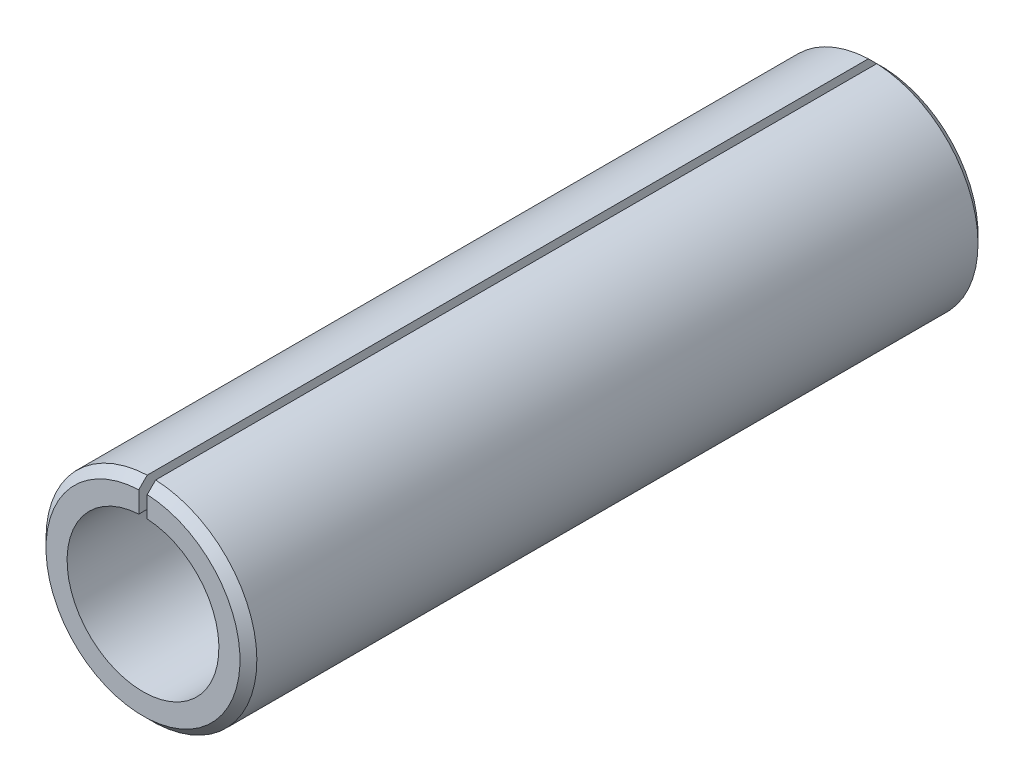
ISO-10303-21;
HEADER;
FILE_DESCRIPTION(('STEP AP214'),'2;1');
FILE_NAME('part.step','',(''),(''),'','','');
FILE_SCHEMA(('AUTOMOTIVE_DESIGN { 1 0 10303 214 1 1 1 1 }'));
ENDSEC;
DATA;
#1=APPLICATION_CONTEXT('core data for automotive mechanical design processes');
#2=APPLICATION_PROTOCOL_DEFINITION('international standard','automotive_design',2000,#1);
#3=PRODUCT_CONTEXT('',#1,'mechanical');
#4=PRODUCT('Part','Part','',(#3));
#5=PRODUCT_RELATED_PRODUCT_CATEGORY('part','',(#4));
#6=PRODUCT_DEFINITION_FORMATION('','',#4);
#7=PRODUCT_DEFINITION_CONTEXT('part definition',#1,'design');
#8=PRODUCT_DEFINITION('design','',#6,#7);
#9=PRODUCT_DEFINITION_SHAPE('','',#8);
#10=(LENGTH_UNIT() NAMED_UNIT(*) SI_UNIT(.MILLI.,.METRE.));
#11=(NAMED_UNIT(*) PLANE_ANGLE_UNIT() SI_UNIT($,.RADIAN.));
#12=(NAMED_UNIT(*) SI_UNIT($,.STERADIAN.) SOLID_ANGLE_UNIT());
#13=UNCERTAINTY_MEASURE_WITH_UNIT(LENGTH_MEASURE(1.E-05),#10,'distance_accuracy_value','');
#14=(GEOMETRIC_REPRESENTATION_CONTEXT(3) GLOBAL_UNCERTAINTY_ASSIGNED_CONTEXT((#13)) GLOBAL_UNIT_ASSIGNED_CONTEXT((#10,
#11,#12)) REPRESENTATION_CONTEXT('',''));
#15=CARTESIAN_POINT('',(0.,0.,0.));
#16=DIRECTION('',(0.,0.,1.));
#17=DIRECTION('',(1.,0.,0.));
#18=AXIS2_PLACEMENT_3D('',#15,#16,#17);
#19=CARTESIAN_POINT('',(0.,0.,5.55625));
#20=DIRECTION('',(0.,0.,-1.));
#21=DIRECTION('',(-1.,0.,0.));
#22=AXIS2_PLACEMENT_3D('',#19,#20,#21);
#23=CYLINDRICAL_SURFACE('',#22,1.143);
#24=CARTESIAN_POINT('',(0.,0.,-5.55625));
#25=DIRECTION('',(0.,0.,-1.));
#26=DIRECTION('',(1.,0.,0.));
#27=AXIS2_PLACEMENT_3D('',#24,#25,#26);
#28=CIRCLE('',#27,1.143);
#29=CARTESIAN_POINT('',(0.0635,1.14123474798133,-5.55625));
#30=VERTEX_POINT('',#29);
#31=CARTESIAN_POINT('',(-0.0635,1.14123474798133,-5.55625));
#32=VERTEX_POINT('',#31);
#33=EDGE_CURVE('E109',#30,#32,#28,.T.);
#34=ORIENTED_EDGE('',*,*,#33,.T.);
#35=DIRECTION('',(0.,0.,-1.));
#36=VECTOR('',#35,1.);
#37=CARTESIAN_POINT('',(-0.0635,1.14123474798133,5.55625));
#38=LINE('',#37,#36);
#39=CARTESIAN_POINT('',(-0.0635,1.14123474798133,5.55625));
#40=VERTEX_POINT('',#39);
#41=EDGE_CURVE('E93',#40,#32,#38,.T.);
#42=ORIENTED_EDGE('',*,*,#41,.F.);
#43=CARTESIAN_POINT('',(0.,0.,5.55625));
#44=DIRECTION('',(0.,0.,-1.));
#45=DIRECTION('',(1.,0.,0.));
#46=AXIS2_PLACEMENT_3D('',#43,#44,#45);
#47=CIRCLE('',#46,1.143);
#48=CARTESIAN_POINT('',(0.0635,1.14123474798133,5.55625));
#49=VERTEX_POINT('',#48);
#50=EDGE_CURVE('E98',#49,#40,#47,.T.);
#51=ORIENTED_EDGE('',*,*,#50,.F.);
#52=DIRECTION('',(0.,0.,-1.));
#53=VECTOR('',#52,1.);
#54=CARTESIAN_POINT('',(0.0635,1.14123474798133,5.55625));
#55=LINE('',#54,#53);
#56=EDGE_CURVE('E225',#49,#30,#55,.T.);
#57=ORIENTED_EDGE('',*,*,#56,.T.);
#58=EDGE_LOOP('',(#34,#42,#51,#57));
#59=FACE_BOUND('',#58,.T.);
#60=ADVANCED_FACE('F35',(#59),#23,.F.);
#61=CARTESIAN_POINT('',(-0.0635,1.14123474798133,5.55625));
#62=DIRECTION('',(-1.,0.,0.));
#63=DIRECTION('',(0.,0.,1.));
#64=AXIS2_PLACEMENT_3D('',#61,#62,#63);
#65=PLANE('',#64);
#66=DIRECTION('',(0.,1.,0.));
#67=VECTOR('',#66,1.);
#68=CARTESIAN_POINT('',(-0.0635,1.14123474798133,-5.55625));
#69=LINE('',#68,#67);
#70=CARTESIAN_POINT('',(-0.0635,1.45911891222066,-5.55625));
#71=VERTEX_POINT('',#70);
#72=EDGE_CURVE('E217',#32,#71,#69,.T.);
#73=ORIENTED_EDGE('',*,*,#72,.T.);
#74=CARTESIAN_POINT('',(-0.0635,1.45911891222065,-5.55625));
#75=CARTESIAN_POINT('',(-0.0635,1.48030477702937,-5.53508410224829));
#76=CARTESIAN_POINT('',(-0.0635,1.50149025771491,-5.51391782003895));
#77=CARTESIAN_POINT('',(-0.0635,1.54386045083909,-5.47158448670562));
#78=CARTESIAN_POINT('',(-0.0635,1.56504516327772,-5.45041743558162));
#79=CARTESIAN_POINT('',(-0.0635,1.58622949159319,-5.42925));
#80=B_SPLINE_CURVE_WITH_KNOTS('',3,(#74,#75,#76,#77,#78,#79),.UNSPECIFIED.,.F.,.F.,(4,2,4),(0.,
0.0898416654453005,0.179683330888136),.UNSPECIFIED.);
#81=CARTESIAN_POINT('',(-0.0634999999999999,1.58622949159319,-5.42925));
#82=VERTEX_POINT('',#81);
#83=EDGE_CURVE('E44',#71,#82,#80,.T.);
#84=ORIENTED_EDGE('',*,*,#83,.T.);
#85=DIRECTION('',(0.,0.,-1.));
#86=VECTOR('',#85,1.);
#87=CARTESIAN_POINT('',(-0.0634999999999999,1.58622949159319,5.55625));
#88=LINE('',#87,#86);
#89=CARTESIAN_POINT('',(-0.0634999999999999,1.58622949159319,5.42925));
#90=VERTEX_POINT('',#89);
#91=EDGE_CURVE('E111',#90,#82,#88,.T.);
#92=ORIENTED_EDGE('',*,*,#91,.F.);
#93=CARTESIAN_POINT('',(-0.0634999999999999,1.58622949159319,5.42925));
#94=CARTESIAN_POINT('',(-0.0635,1.56504516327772,5.45041743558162));
#95=CARTESIAN_POINT('',(-0.0635,1.54386045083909,5.47158448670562));
#96=CARTESIAN_POINT('',(-0.0635,1.50149025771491,5.51391782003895));
#97=CARTESIAN_POINT('',(-0.0635,1.48030477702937,5.53508410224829));
#98=CARTESIAN_POINT('',(-0.0635,1.45911891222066,5.55625));
#99=B_SPLINE_CURVE_WITH_KNOTS('',3,(#93,#94,#95,#96,#97,#98),.UNSPECIFIED.,.F.,.F.,(4,2,4),(0.,
0.0898416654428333,0.179683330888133),.UNSPECIFIED.);
#100=CARTESIAN_POINT('',(-0.0635,1.45911891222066,5.55625));
#101=VERTEX_POINT('',#100);
#102=EDGE_CURVE('E51',#90,#101,#99,.T.);
#103=ORIENTED_EDGE('',*,*,#102,.T.);
#104=DIRECTION('',(0.,1.,0.));
#105=VECTOR('',#104,1.);
#106=CARTESIAN_POINT('',(-0.0635,1.14123474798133,5.55625));
#107=LINE('',#106,#105);
#108=EDGE_CURVE('E89',#40,#101,#107,.T.);
#109=ORIENTED_EDGE('',*,*,#108,.F.);
#110=ORIENTED_EDGE('',*,*,#41,.T.);
#111=EDGE_LOOP('',(#73,#84,#92,#103,#109,#110));
#112=FACE_BOUND('',#111,.T.);
#113=ADVANCED_FACE('F91',(#112),#65,.F.);
#114=CARTESIAN_POINT('',(0.,0.,5.55625));
#115=DIRECTION('',(0.,0.,-1.));
#116=DIRECTION('',(-1.,0.,0.));
#117=AXIS2_PLACEMENT_3D('',#114,#115,#116);
#118=CYLINDRICAL_SURFACE('',#117,1.5875);
#119=ORIENTED_EDGE('',*,*,#91,.T.);
#120=CARTESIAN_POINT('',(0.,0.,-5.42925));
#121=DIRECTION('',(0.,0.,1.));
#122=DIRECTION('',(1.,0.,0.));
#123=AXIS2_PLACEMENT_3D('',#120,#121,#122);
#124=CIRCLE('',#123,1.5875);
#125=CARTESIAN_POINT('',(0.0635,1.58622949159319,-5.42925));
#126=VERTEX_POINT('',#125);
#127=EDGE_CURVE('E113',#82,#126,#124,.T.);
#128=ORIENTED_EDGE('',*,*,#127,.T.);
#129=DIRECTION('',(0.,0.,-1.));
#130=VECTOR('',#129,1.);
#131=CARTESIAN_POINT('',(0.0635,1.58622949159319,5.55625));
#132=LINE('',#131,#130);
#133=CARTESIAN_POINT('',(0.0635,1.58622949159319,5.42925));
#134=VERTEX_POINT('',#133);
#135=EDGE_CURVE('E116',#134,#126,#132,.T.);
#136=ORIENTED_EDGE('',*,*,#135,.F.);
#137=CARTESIAN_POINT('',(0.,0.,5.42925));
#138=DIRECTION('',(0.,0.,1.));
#139=DIRECTION('',(1.,0.,0.));
#140=AXIS2_PLACEMENT_3D('',#137,#138,#139);
#141=CIRCLE('',#140,1.5875);
#142=EDGE_CURVE('E110',#134,#90,#141,.F.);
#143=ORIENTED_EDGE('',*,*,#142,.T.);
#144=EDGE_LOOP('',(#119,#128,#136,#143));
#145=FACE_BOUND('',#144,.T.);
#146=ADVANCED_FACE('F138',(#145),#118,.T.);
#147=CARTESIAN_POINT('',(0.0635,1.14123474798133,5.55625));
#148=DIRECTION('',(1.,0.,0.));
#149=DIRECTION('',(0.,0.,-1.));
#150=AXIS2_PLACEMENT_3D('',#147,#148,#149);
#151=PLANE('',#150);
#152=ORIENTED_EDGE('',*,*,#135,.T.);
#153=CARTESIAN_POINT('',(0.0635,1.58622949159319,-5.42925));
#154=CARTESIAN_POINT('',(0.0635,1.56504516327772,-5.45041743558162));
#155=CARTESIAN_POINT('',(0.0635,1.54386045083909,-5.47158448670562));
#156=CARTESIAN_POINT('',(0.0635,1.50149025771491,-5.51391782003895));
#157=CARTESIAN_POINT('',(0.0635,1.48030477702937,-5.53508410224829));
#158=CARTESIAN_POINT('',(0.0635,1.45911891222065,-5.55625));
#159=B_SPLINE_CURVE_WITH_KNOTS('',3,(#153,#154,#155,#156,#157,#158),.UNSPECIFIED.,.F.,.F.,(4,2,
4),(0.,0.0898416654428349,0.179683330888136),.UNSPECIFIED.);
#160=CARTESIAN_POINT('',(0.0635,1.45911891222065,-5.55625));
#161=VERTEX_POINT('',#160);
#162=EDGE_CURVE('E128',#126,#161,#159,.T.);
#163=ORIENTED_EDGE('',*,*,#162,.T.);
#164=DIRECTION('',(0.,-1.,0.));
#165=VECTOR('',#164,1.);
#166=CARTESIAN_POINT('',(0.0635,1.14123474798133,-5.55625));
#167=LINE('',#166,#165);
#168=EDGE_CURVE('E106',#161,#30,#167,.T.);
#169=ORIENTED_EDGE('',*,*,#168,.T.);
#170=ORIENTED_EDGE('',*,*,#56,.F.);
#171=DIRECTION('',(0.,-1.,0.));
#172=VECTOR('',#171,1.);
#173=CARTESIAN_POINT('',(0.0635,1.14123474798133,5.55625));
#174=LINE('',#173,#172);
#175=CARTESIAN_POINT('',(0.0635,1.45911891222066,5.55625));
#176=VERTEX_POINT('',#175);
#177=EDGE_CURVE('E97',#176,#49,#174,.T.);
#178=ORIENTED_EDGE('',*,*,#177,.F.);
#179=CARTESIAN_POINT('',(0.0635,1.45911891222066,5.55625));
#180=CARTESIAN_POINT('',(0.0635,1.48030477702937,5.53508410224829));
#181=CARTESIAN_POINT('',(0.0635,1.50149025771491,5.51391782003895));
#182=CARTESIAN_POINT('',(0.0635,1.54386045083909,5.47158448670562));
#183=CARTESIAN_POINT('',(0.0635,1.56504516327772,5.45041743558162));
#184=CARTESIAN_POINT('',(0.0635,1.58622949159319,5.42925));
#185=B_SPLINE_CURVE_WITH_KNOTS('',3,(#179,#180,#181,#182,#183,#184),.UNSPECIFIED.,.F.,.F.,(4,2,
4),(0.,0.089841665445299,0.179683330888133),.UNSPECIFIED.);
#186=EDGE_CURVE('E122',#176,#134,#185,.T.);
#187=ORIENTED_EDGE('',*,*,#186,.T.);
#188=EDGE_LOOP('',(#152,#163,#169,#170,#178,#187));
#189=FACE_BOUND('',#188,.T.);
#190=ADVANCED_FACE('F133',(#189),#151,.F.);
#191=CARTESIAN_POINT('',(0.,0.,5.55625));
#192=DIRECTION('',(0.,0.,1.));
#193=DIRECTION('',(1.,0.,0.));
#194=AXIS2_PLACEMENT_3D('',#191,#192,#193);
#195=PLANE('',#194);
#196=ORIENTED_EDGE('',*,*,#108,.T.);
#197=CARTESIAN_POINT('',(0.,0.,5.55625));
#198=DIRECTION('',(0.,0.,1.));
#199=DIRECTION('',(1.,0.,0.));
#200=AXIS2_PLACEMENT_3D('',#197,#198,#199);
#201=CIRCLE('',#200,1.4605);
#202=EDGE_CURVE('E11',#101,#176,#201,.T.);
#203=ORIENTED_EDGE('',*,*,#202,.T.);
#204=ORIENTED_EDGE('',*,*,#177,.T.);
#205=ORIENTED_EDGE('',*,*,#50,.T.);
#206=EDGE_LOOP('',(#196,#203,#204,#205));
#207=FACE_BOUND('',#206,.T.);
#208=ADVANCED_FACE('F101',(#207),#195,.T.);
#209=CARTESIAN_POINT('',(0.,0.,-5.55625));
#210=DIRECTION('',(0.,0.,1.));
#211=DIRECTION('',(1.,0.,0.));
#212=AXIS2_PLACEMENT_3D('',#209,#210,#211);
#213=PLANE('',#212);
#214=ORIENTED_EDGE('',*,*,#168,.F.);
#215=CARTESIAN_POINT('',(0.,0.,-5.55625));
#216=DIRECTION('',(0.,0.,1.));
#217=DIRECTION('',(1.,0.,0.));
#218=AXIS2_PLACEMENT_3D('',#215,#216,#217);
#219=CIRCLE('',#218,1.4605);
#220=EDGE_CURVE('E59',#161,#71,#219,.F.);
#221=ORIENTED_EDGE('',*,*,#220,.T.);
#222=ORIENTED_EDGE('',*,*,#72,.F.);
#223=ORIENTED_EDGE('',*,*,#33,.F.);
#224=EDGE_LOOP('',(#214,#221,#222,#223));
#225=FACE_BOUND('',#224,.T.);
#226=ADVANCED_FACE('F140',(#225),#213,.F.);
#227=CARTESIAN_POINT('',(0.,0.,-5.42925));
#228=DIRECTION('',(0.,0.,1.));
#229=DIRECTION('',(1.,0.,0.));
#230=AXIS2_PLACEMENT_3D('',#227,#228,#229);
#231=CONICAL_SURFACE('',#230,1.5875,0.785398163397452);
#232=ORIENTED_EDGE('',*,*,#83,.F.);
#233=ORIENTED_EDGE('',*,*,#220,.F.);
#234=ORIENTED_EDGE('',*,*,#162,.F.);
#235=ORIENTED_EDGE('',*,*,#127,.F.);
#236=EDGE_LOOP('',(#232,#233,#234,#235));
#237=FACE_BOUND('',#236,.T.);
#238=ADVANCED_FACE('F157',(#237),#231,.T.);
#239=CARTESIAN_POINT('',(0.,0.,5.55625));
#240=DIRECTION('',(0.,0.,-1.));
#241=DIRECTION('',(-1.,0.,0.));
#242=AXIS2_PLACEMENT_3D('',#239,#240,#241);
#243=CONICAL_SURFACE('',#242,1.4605,0.785398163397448);
#244=ORIENTED_EDGE('',*,*,#102,.F.);
#245=ORIENTED_EDGE('',*,*,#142,.F.);
#246=ORIENTED_EDGE('',*,*,#186,.F.);
#247=ORIENTED_EDGE('',*,*,#202,.F.);
#248=EDGE_LOOP('',(#244,#245,#246,#247));
#249=FACE_BOUND('',#248,.T.);
#250=ADVANCED_FACE('F37',(#249),#243,.T.);
#251=CLOSED_SHELL('',(#60,#113,#146,#190,#208,#226,#238,#250));
#252=MANIFOLD_SOLID_BREP('B2',#251);
#253=ADVANCED_BREP_SHAPE_REPRESENTATION('',(#18,#252),#14);
#254=SHAPE_DEFINITION_REPRESENTATION(#9,#253);
ENDSEC;
END-ISO-10303-21;
